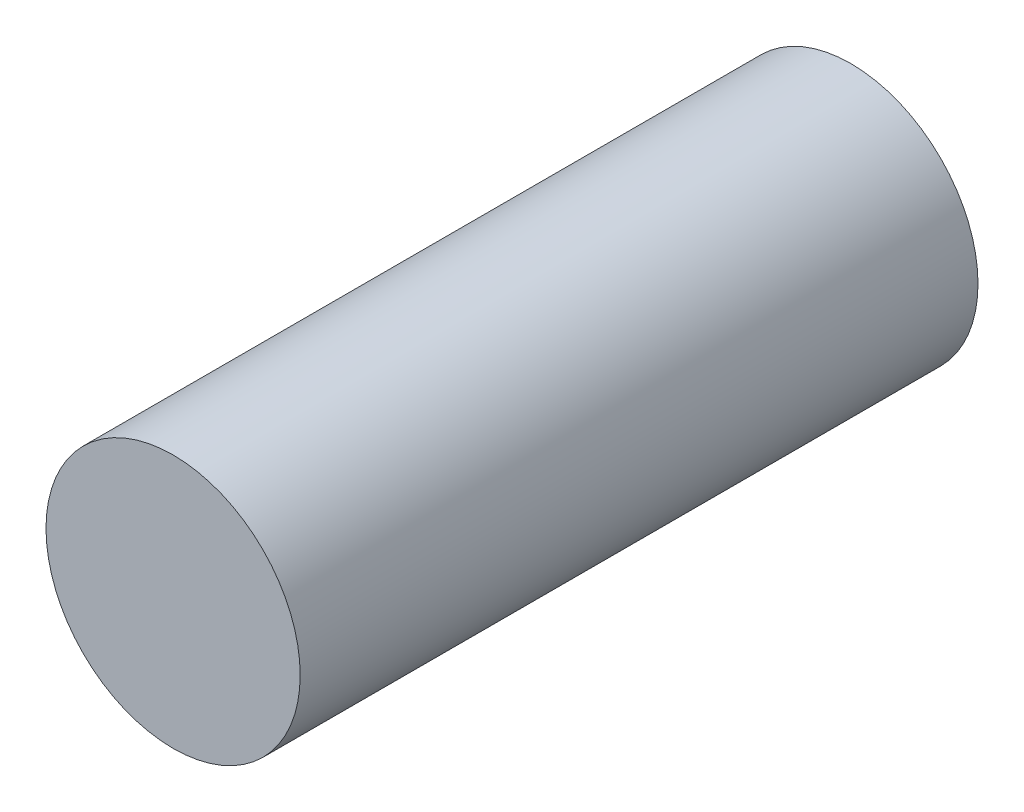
from build123d import *

# Parameters (mm, degrees)
ESQUISSE1_R        = 7.5
BOSS_EXTRU_1_DEPTH = 40


with BuildPart() as part:
    # Esquisse1 → Boss.-Extru.1 (new body)
    with BuildSketch(Plane.XY):
        Circle(ESQUISSE1_R)
    extrude(amount=BOSS_EXTRU_1_DEPTH)


solid = part.part
